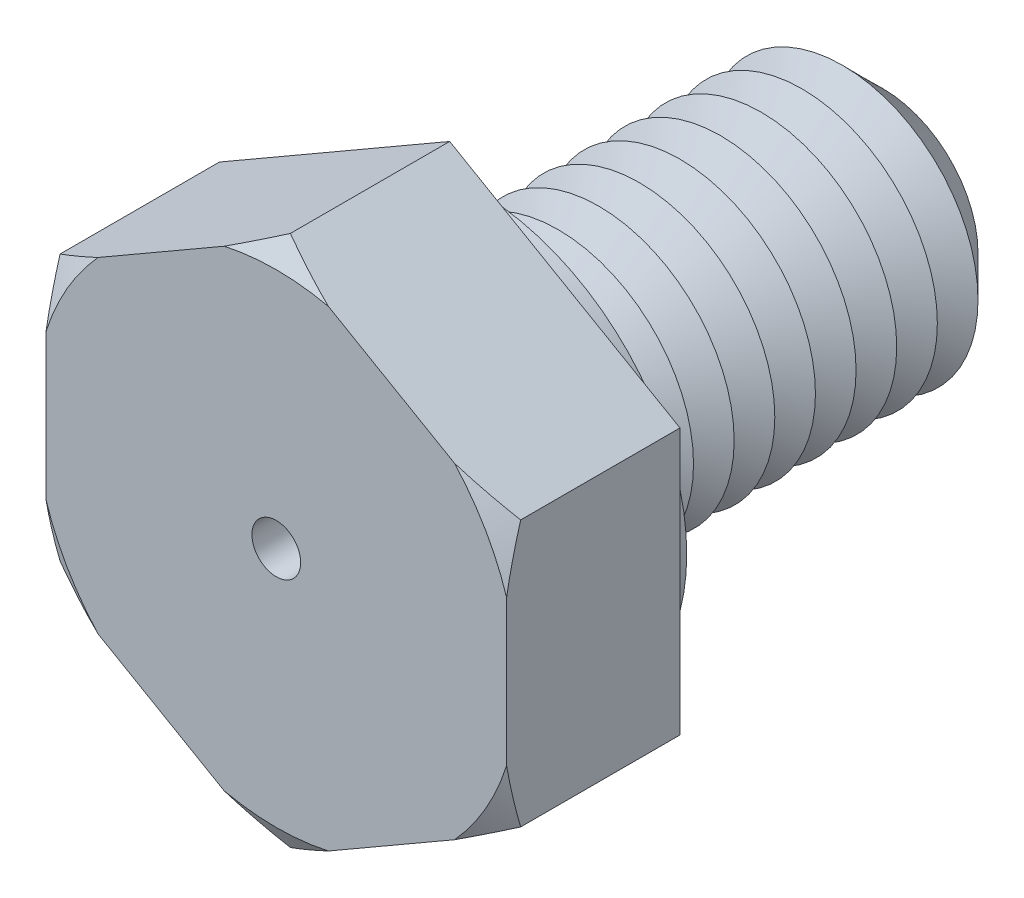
from build123d import *

# Parameters (mm, degrees)
BOSS_EXTRUDE1_DEPTH = 6.4
SKETCH3_R           = 5
BOSS_EXTRUDE2_DEPTH = 16
SKETCH4_R           = 7.75
BOSS_EXTRUDE3_DEPTH = 1
CHAMFER1_SIZE       = 1.5
LPATTERN1_COUNT     = 9
LPATTERN1_PITCH     = 1.5
SKETCH8_R           = 0.9
CUT_EXTRUDE1_DEPTH  = 22.4


with BuildPart() as part:
    # Sketch2 → Boss-Extrude1 (new body)
    with BuildSketch(Plane.XY):
        Polygon((0, 9.814954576), (-8.5, 4.907477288), (-8.5, -4.907477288), (0, -9.814954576), (8.5, -4.907477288), (8.5, 4.907477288), align=None)
    extrude(amount=BOSS_EXTRUDE1_DEPTH)

    # Sketch3 → Boss-Extrude2 (add)
    with BuildSketch(Plane(origin=(0, 0, 0), x_dir=(-1, 0, 0), z_dir=(0, 0, -1))):
        Circle(SKETCH3_R)
    extrude(amount=BOSS_EXTRUDE2_DEPTH)

    # Sketch4 → Boss-Extrude3 (add)
    with BuildSketch(Plane(origin=(0, 0, 0), x_dir=(-1, 0, 0), z_dir=(0, 0, -1))):
        with Locations(Location((0, 0, 0), (0, 0, 180))):
            Circle(SKETCH4_R)
    extrude(amount=BOSS_EXTRUDE3_DEPTH)

    # Chamfer1
    chamfer1_edges = [part.edges().sort_by_distance(p)[0] for p in [
        (5, 0, -16),
    ]]
    chamfer(chamfer1_edges, length=CHAMFER1_SIZE)

    # Sketch6 → Cut-Revolve1 (revolve, cut)
    with BuildSketch(Plane(origin=(0, 0, 0), x_dir=(0, 0, -1), z_dir=(1, 0, 0)), mode=Mode.PRIVATE) as cut_revolve1_sk:
        Polygon((1, 5), (1.75, 3.700961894), (2.5, 5), align=None)
    cut_revolve1 = revolve(cut_revolve1_sk.sketch.rotate(Axis((0, 0, 3.211670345), (0, 0, -1)), 90), axis=Axis((0, 0, 3.211670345), (0, 0, -1)), mode=Mode.SUBTRACT)

    # LPattern1: Cut-Revolve1 ×9
    with Locations(*[(0, 0, -i * LPATTERN1_PITCH) for i in range(1, LPATTERN1_COUNT)]):
        add(cut_revolve1, mode=Mode.SUBTRACT)

    # Sketch7 → Cut-Revolve2 (revolve, cut)
    with BuildSketch(Plane(origin=(0, 0, 0), x_dir=(0, 0, -1), z_dir=(1, 0, 0)), mode=Mode.PRIVATE) as cut_revolve2_sk:
        Polygon((-6.4, 9.814954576), (-6.4, 8.914954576), (-5.880384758, 9.814954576), align=None)
    revolve(cut_revolve2_sk.sketch.rotate(Axis((0, 0, 3.211670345), (0, 0, -1)), 90), axis=Axis((0, 0, 3.211670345), (0, 0, -1)), mode=Mode.SUBTRACT)

    # Sketch8 → Cut-Extrude1 (cut)
    with BuildSketch(Plane.XY.offset(6.4)):
        Circle(SKETCH8_R)
    extrude(amount=-CUT_EXTRUDE1_DEPTH, mode=Mode.SUBTRACT)


solid = part.part
